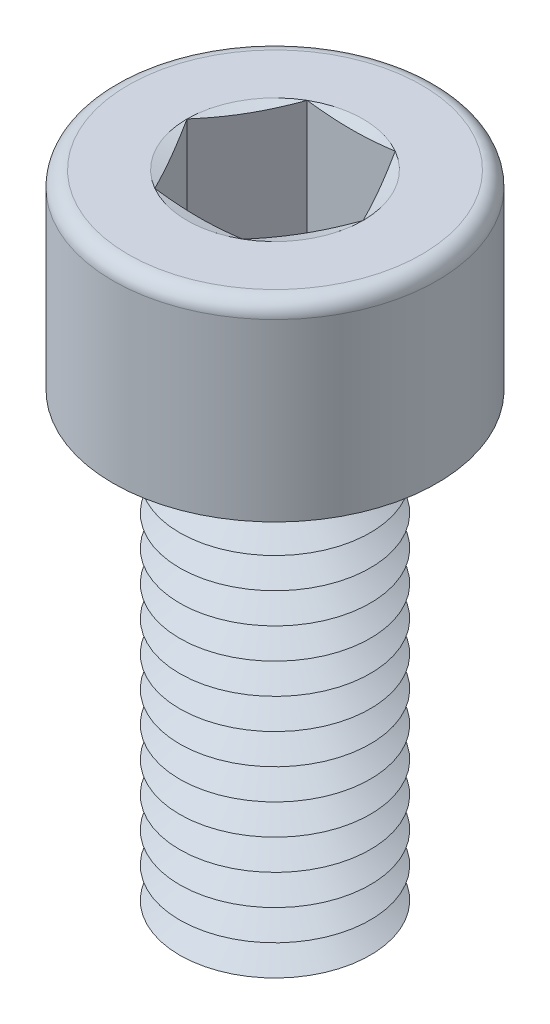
from build123d import *

# Parameters (mm, degrees)
SKETCH1_R       = 2.5
EXTRUDE1_DEPTH  = 12
SKETCH2_R       = 4.25
EXTRUDE2_DEPTH  = 5
EXTRUDE3_DEPTH  = 4
FILLET1_R       = 0.4
LPATTERN1_COUNT = 15
LPATTERN1_PITCH = 0.8


with BuildPart() as part:
    # Sketch1 → Extrude1 (new body)
    with BuildSketch(Plane(origin=(0, 0, 0), x_dir=(1, 0, 0), z_dir=(0, 1, 0))):
        with Locations(Location((0, 0, 0), (0, 0, 270))):
            Circle(SKETCH1_R)
    extrude(amount=EXTRUDE1_DEPTH)

    # Sketch2 → Extrude2 (add)
    with BuildSketch(Plane(origin=(0, 12, 0), x_dir=(1, 0, 0), z_dir=(0, 1, 0))):
        with Locations(Location((0, 0, 0), (0, 0, 270))):
            Circle(SKETCH2_R)
    extrude(amount=EXTRUDE2_DEPTH)

    # Sketch3 → Extrude3 (cut)
    with BuildSketch(Plane(origin=(0, 17, 0), x_dir=(1, 0, 0), z_dir=(0, 1, 0))):
        Polygon((1.154700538, 2), (-1.154700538, 2), (-2.309401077, 0), (-1.154700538, -2), (1.154700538, -2), (2.309401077, 0), align=None)
    extrude(amount=-EXTRUDE3_DEPTH, mode=Mode.SUBTRACT)

    # Fillet1
    fillet1_edges = [part.edges().sort_by_distance(p)[0] for p in [
        (0, 17, -4.25),
    ]]
    fillet(fillet1_edges, radius=FILLET1_R)

    # Sketch4 → Cut-Revolve1 (revolve, cut)
    with BuildSketch(Plane(origin=(0, 0, 0), x_dir=(0, 0, -1), z_dir=(1, 0, 0))):
        Polygon((-2, 13), (0, 13), (0, 11.845299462), align=None)
    revolve(axis=Axis((0, 13, 0), (0, -1, 0)), mode=Mode.SUBTRACT)

    # Sketch5 → Cut-Revolve2 (revolve, cut)
    with BuildSketch(Plane.XY, mode=Mode.PRIVATE) as cut_revolve2_sk:
        Polygon((-2.5, 0.4), (-2.5, -0.4), (-1.807179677, 0), align=None)
    cut_revolve2 = revolve(cut_revolve2_sk.sketch.rotate(Axis((0, 12, 0), (0, -1, 0)), 270), axis=Axis((0, 12, 0), (0, -1, 0)), mode=Mode.SUBTRACT)

    # LPattern1: Cut-Revolve2 ×15
    with Locations(*[(0, i * LPATTERN1_PITCH, 0) for i in range(1, LPATTERN1_COUNT)]):
        add(cut_revolve2, mode=Mode.SUBTRACT)

    # Extrude4 cone 1 section (on through the dimple's axis) → Extrude4 (revolve, cut)
    with BuildSketch(Plane(origin=(0, 17, 0), x_dir=(0, 0, 1), z_dir=(1, 0, 0))):
        Polygon((0, 0), (2.309401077, 0), (0, 0.618802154), align=None)
    revolve(axis=Axis((0, 17, 0), (0, -1, 0)), mode=Mode.SUBTRACT)


solid = part.part
